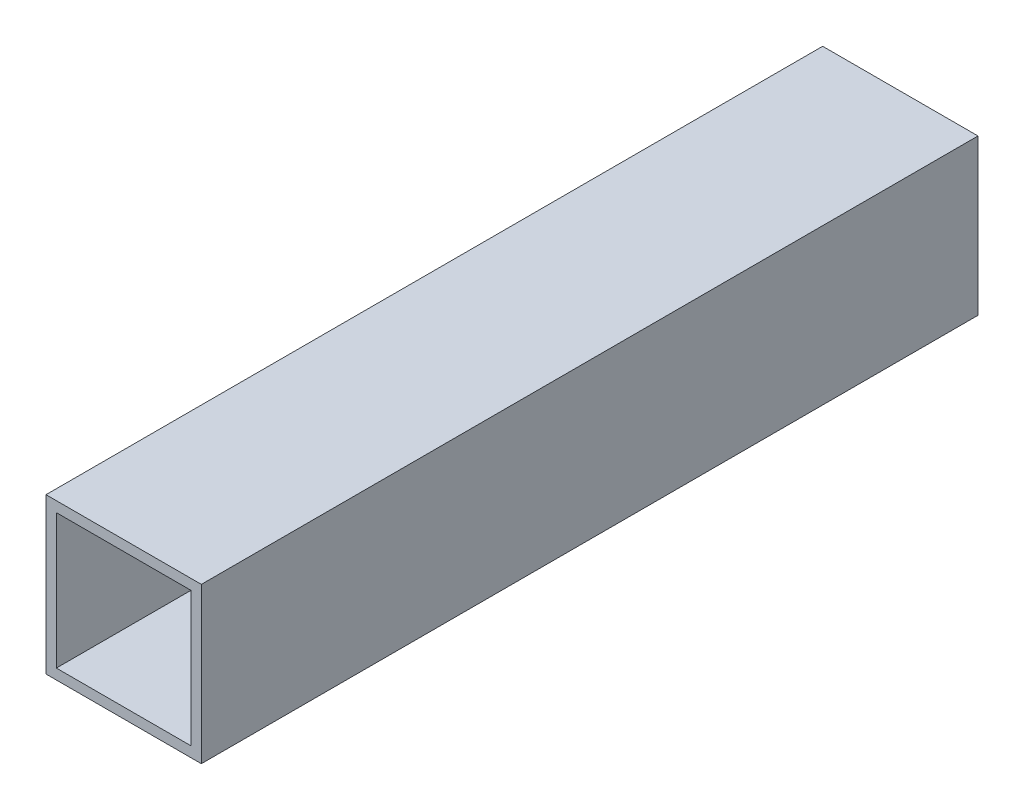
ISO-10303-21;
HEADER;
FILE_DESCRIPTION(('STEP AP214'),'2;1');
FILE_NAME('part.step','',(''),(''),'','','');
FILE_SCHEMA(('AUTOMOTIVE_DESIGN { 1 0 10303 214 1 1 1 1 }'));
ENDSEC;
DATA;
#1=APPLICATION_CONTEXT('core data for automotive mechanical design processes');
#2=APPLICATION_PROTOCOL_DEFINITION('international standard','automotive_design',2000,#1);
#3=PRODUCT_CONTEXT('',#1,'mechanical');
#4=PRODUCT('Part','Part','',(#3));
#5=PRODUCT_RELATED_PRODUCT_CATEGORY('part','',(#4));
#6=PRODUCT_DEFINITION_FORMATION('','',#4);
#7=PRODUCT_DEFINITION_CONTEXT('part definition',#1,'design');
#8=PRODUCT_DEFINITION('design','',#6,#7);
#9=PRODUCT_DEFINITION_SHAPE('','',#8);
#10=(LENGTH_UNIT() NAMED_UNIT(*) SI_UNIT(.MILLI.,.METRE.));
#11=(NAMED_UNIT(*) PLANE_ANGLE_UNIT() SI_UNIT($,.RADIAN.));
#12=(NAMED_UNIT(*) SI_UNIT($,.STERADIAN.) SOLID_ANGLE_UNIT());
#13=UNCERTAINTY_MEASURE_WITH_UNIT(LENGTH_MEASURE(1.E-05),#10,'distance_accuracy_value','');
#14=(GEOMETRIC_REPRESENTATION_CONTEXT(3) GLOBAL_UNCERTAINTY_ASSIGNED_CONTEXT((#13)) GLOBAL_UNIT_ASSIGNED_CONTEXT((#10,
#11,#12)) REPRESENTATION_CONTEXT('',''));
#15=CARTESIAN_POINT('',(0.,0.,0.));
#16=DIRECTION('',(0.,0.,1.));
#17=DIRECTION('',(1.,0.,0.));
#18=AXIS2_PLACEMENT_3D('',#15,#16,#17);
#19=CARTESIAN_POINT('',(-15.,-15.,150.));
#20=DIRECTION('',(0.,0.,1.));
#21=DIRECTION('',(1.,0.,0.));
#22=AXIS2_PLACEMENT_3D('',#19,#20,#21);
#23=PLANE('',#22);
#24=DIRECTION('',(0.,-1.,0.));
#25=VECTOR('',#24,1.);
#26=CARTESIAN_POINT('',(-15.,15.,150.));
#27=LINE('',#26,#25);
#28=CARTESIAN_POINT('',(-15.,15.,150.));
#29=VERTEX_POINT('',#28);
#30=CARTESIAN_POINT('',(-15.,-15.,150.));
#31=VERTEX_POINT('',#30);
#32=EDGE_CURVE('E155',#29,#31,#27,.T.);
#33=ORIENTED_EDGE('',*,*,#32,.T.);
#34=DIRECTION('',(1.,0.,0.));
#35=VECTOR('',#34,1.);
#36=CARTESIAN_POINT('',(-15.,-15.,150.));
#37=LINE('',#36,#35);
#38=CARTESIAN_POINT('',(15.,-15.,150.));
#39=VERTEX_POINT('',#38);
#40=EDGE_CURVE('E158',#31,#39,#37,.T.);
#41=ORIENTED_EDGE('',*,*,#40,.T.);
#42=DIRECTION('',(0.,1.,0.));
#43=VECTOR('',#42,1.);
#44=CARTESIAN_POINT('',(15.,15.,150.));
#45=LINE('',#44,#43);
#46=CARTESIAN_POINT('',(15.,15.,150.));
#47=VERTEX_POINT('',#46);
#48=EDGE_CURVE('E161',#39,#47,#45,.T.);
#49=ORIENTED_EDGE('',*,*,#48,.T.);
#50=DIRECTION('',(-1.,0.,0.));
#51=VECTOR('',#50,1.);
#52=CARTESIAN_POINT('',(-15.,15.,150.));
#53=LINE('',#52,#51);
#54=EDGE_CURVE('E163',#47,#29,#53,.T.);
#55=ORIENTED_EDGE('',*,*,#54,.T.);
#56=EDGE_LOOP('',(#33,#41,#49,#55));
#57=FACE_BOUND('',#56,.T.);
#58=DIRECTION('',(1.,0.,0.));
#59=VECTOR('',#58,1.);
#60=CARTESIAN_POINT('',(-15.,-13.,150.));
#61=LINE('',#60,#59);
#62=CARTESIAN_POINT('',(-13.,-13.,150.));
#63=VERTEX_POINT('',#62);
#64=CARTESIAN_POINT('',(13.,-13.,150.));
#65=VERTEX_POINT('',#64);
#66=EDGE_CURVE('E127',#63,#65,#61,.T.);
#67=ORIENTED_EDGE('',*,*,#66,.F.);
#68=DIRECTION('',(0.,-1.,0.));
#69=VECTOR('',#68,1.);
#70=CARTESIAN_POINT('',(-13.,15.,150.));
#71=LINE('',#70,#69);
#72=CARTESIAN_POINT('',(-13.,13.,150.));
#73=VERTEX_POINT('',#72);
#74=EDGE_CURVE('E119',#73,#63,#71,.T.);
#75=ORIENTED_EDGE('',*,*,#74,.F.);
#76=DIRECTION('',(-1.,0.,0.));
#77=VECTOR('',#76,1.);
#78=CARTESIAN_POINT('',(-15.,13.,150.));
#79=LINE('',#78,#77);
#80=CARTESIAN_POINT('',(13.,13.,150.));
#81=VERTEX_POINT('',#80);
#82=EDGE_CURVE('E141',#81,#73,#79,.T.);
#83=ORIENTED_EDGE('',*,*,#82,.F.);
#84=DIRECTION('',(0.,1.,0.));
#85=VECTOR('',#84,1.);
#86=CARTESIAN_POINT('',(13.,15.,150.));
#87=LINE('',#86,#85);
#88=EDGE_CURVE('E139',#65,#81,#87,.T.);
#89=ORIENTED_EDGE('',*,*,#88,.F.);
#90=EDGE_LOOP('',(#67,#75,#83,#89));
#91=FACE_BOUND('',#90,.T.);
#92=ADVANCED_FACE('F54',(#57,#91),#23,.T.);
#93=CARTESIAN_POINT('',(-15.,-15.,0.));
#94=DIRECTION('',(0.,0.,1.));
#95=DIRECTION('',(1.,0.,0.));
#96=AXIS2_PLACEMENT_3D('',#93,#94,#95);
#97=PLANE('',#96);
#98=DIRECTION('',(0.,-1.,0.));
#99=VECTOR('',#98,1.);
#100=CARTESIAN_POINT('',(-15.,15.,0.));
#101=LINE('',#100,#99);
#102=CARTESIAN_POINT('',(-15.,15.,0.));
#103=VERTEX_POINT('',#102);
#104=CARTESIAN_POINT('',(-15.,-15.,0.));
#105=VERTEX_POINT('',#104);
#106=EDGE_CURVE('E135',#103,#105,#101,.T.);
#107=ORIENTED_EDGE('',*,*,#106,.F.);
#108=DIRECTION('',(-1.,0.,0.));
#109=VECTOR('',#108,1.);
#110=CARTESIAN_POINT('',(-15.,15.,0.));
#111=LINE('',#110,#109);
#112=CARTESIAN_POINT('',(15.,15.,0.));
#113=VERTEX_POINT('',#112);
#114=EDGE_CURVE('E159',#113,#103,#111,.T.);
#115=ORIENTED_EDGE('',*,*,#114,.F.);
#116=DIRECTION('',(0.,1.,0.));
#117=VECTOR('',#116,1.);
#118=CARTESIAN_POINT('',(15.,15.,0.));
#119=LINE('',#118,#117);
#120=CARTESIAN_POINT('',(15.,-15.,0.));
#121=VERTEX_POINT('',#120);
#122=EDGE_CURVE('E170',#121,#113,#119,.T.);
#123=ORIENTED_EDGE('',*,*,#122,.F.);
#124=DIRECTION('',(1.,0.,0.));
#125=VECTOR('',#124,1.);
#126=CARTESIAN_POINT('',(-15.,-15.,0.));
#127=LINE('',#126,#125);
#128=EDGE_CURVE('E168',#105,#121,#127,.T.);
#129=ORIENTED_EDGE('',*,*,#128,.F.);
#130=EDGE_LOOP('',(#107,#115,#123,#129));
#131=FACE_BOUND('',#130,.T.);
#132=DIRECTION('',(0.,-1.,0.));
#133=VECTOR('',#132,1.);
#134=CARTESIAN_POINT('',(-13.,15.,0.));
#135=LINE('',#134,#133);
#136=CARTESIAN_POINT('',(-13.,13.,0.));
#137=VERTEX_POINT('',#136);
#138=CARTESIAN_POINT('',(-13.,-13.,0.));
#139=VERTEX_POINT('',#138);
#140=EDGE_CURVE('E77',#137,#139,#135,.T.);
#141=ORIENTED_EDGE('',*,*,#140,.T.);
#142=DIRECTION('',(1.,0.,0.));
#143=VECTOR('',#142,1.);
#144=CARTESIAN_POINT('',(-15.,-13.,0.));
#145=LINE('',#144,#143);
#146=CARTESIAN_POINT('',(13.,-13.,0.));
#147=VERTEX_POINT('',#146);
#148=EDGE_CURVE('E134',#139,#147,#145,.T.);
#149=ORIENTED_EDGE('',*,*,#148,.T.);
#150=DIRECTION('',(0.,1.,0.));
#151=VECTOR('',#150,1.);
#152=CARTESIAN_POINT('',(13.,15.,0.));
#153=LINE('',#152,#151);
#154=CARTESIAN_POINT('',(13.,13.,0.));
#155=VERTEX_POINT('',#154);
#156=EDGE_CURVE('E147',#147,#155,#153,.T.);
#157=ORIENTED_EDGE('',*,*,#156,.T.);
#158=DIRECTION('',(-1.,0.,0.));
#159=VECTOR('',#158,1.);
#160=CARTESIAN_POINT('',(-15.,13.,0.));
#161=LINE('',#160,#159);
#162=EDGE_CURVE('E128',#155,#137,#161,.T.);
#163=ORIENTED_EDGE('',*,*,#162,.T.);
#164=EDGE_LOOP('',(#141,#149,#157,#163));
#165=FACE_BOUND('',#164,.T.);
#166=ADVANCED_FACE('F188',(#131,#165),#97,.F.);
#167=CARTESIAN_POINT('',(-15.,15.,150.));
#168=DIRECTION('',(1.,0.,0.));
#169=DIRECTION('',(0.,1.,0.));
#170=AXIS2_PLACEMENT_3D('',#167,#168,#169);
#171=PLANE('',#170);
#172=ORIENTED_EDGE('',*,*,#106,.T.);
#173=DIRECTION('',(0.,0.,-1.));
#174=VECTOR('',#173,1.);
#175=CARTESIAN_POINT('',(-15.,-15.,150.));
#176=LINE('',#175,#174);
#177=EDGE_CURVE('E12',#31,#105,#176,.T.);
#178=ORIENTED_EDGE('',*,*,#177,.F.);
#179=ORIENTED_EDGE('',*,*,#32,.F.);
#180=DIRECTION('',(0.,0.,-1.));
#181=VECTOR('',#180,1.);
#182=CARTESIAN_POINT('',(-15.,15.,150.));
#183=LINE('',#182,#181);
#184=EDGE_CURVE('E165',#29,#103,#183,.T.);
#185=ORIENTED_EDGE('',*,*,#184,.T.);
#186=EDGE_LOOP('',(#172,#178,#179,#185));
#187=FACE_BOUND('',#186,.T.);
#188=ADVANCED_FACE('F56',(#187),#171,.F.);
#189=CARTESIAN_POINT('',(-15.,-15.,150.));
#190=DIRECTION('',(0.,1.,0.));
#191=DIRECTION('',(-1.,0.,0.));
#192=AXIS2_PLACEMENT_3D('',#189,#190,#191);
#193=PLANE('',#192);
#194=ORIENTED_EDGE('',*,*,#128,.T.);
#195=DIRECTION('',(0.,0.,-1.));
#196=VECTOR('',#195,1.);
#197=CARTESIAN_POINT('',(15.,-15.,150.));
#198=LINE('',#197,#196);
#199=EDGE_CURVE('E62',#39,#121,#198,.T.);
#200=ORIENTED_EDGE('',*,*,#199,.F.);
#201=ORIENTED_EDGE('',*,*,#40,.F.);
#202=ORIENTED_EDGE('',*,*,#177,.T.);
#203=EDGE_LOOP('',(#194,#200,#201,#202));
#204=FACE_BOUND('',#203,.T.);
#205=ADVANCED_FACE('F198',(#204),#193,.F.);
#206=CARTESIAN_POINT('',(15.,15.,150.));
#207=DIRECTION('',(-1.,0.,0.));
#208=DIRECTION('',(0.,0.,1.));
#209=AXIS2_PLACEMENT_3D('',#206,#207,#208);
#210=PLANE('',#209);
#211=ORIENTED_EDGE('',*,*,#122,.T.);
#212=DIRECTION('',(0.,0.,-1.));
#213=VECTOR('',#212,1.);
#214=CARTESIAN_POINT('',(15.,15.,150.));
#215=LINE('',#214,#213);
#216=EDGE_CURVE('E175',#47,#113,#215,.T.);
#217=ORIENTED_EDGE('',*,*,#216,.F.);
#218=ORIENTED_EDGE('',*,*,#48,.F.);
#219=ORIENTED_EDGE('',*,*,#199,.T.);
#220=EDGE_LOOP('',(#211,#217,#218,#219));
#221=FACE_BOUND('',#220,.T.);
#222=ADVANCED_FACE('F182',(#221),#210,.F.);
#223=CARTESIAN_POINT('',(-15.,15.,150.));
#224=DIRECTION('',(0.,-1.,0.));
#225=DIRECTION('',(1.,0.,0.));
#226=AXIS2_PLACEMENT_3D('',#223,#224,#225);
#227=PLANE('',#226);
#228=ORIENTED_EDGE('',*,*,#114,.T.);
#229=ORIENTED_EDGE('',*,*,#184,.F.);
#230=ORIENTED_EDGE('',*,*,#54,.F.);
#231=ORIENTED_EDGE('',*,*,#216,.T.);
#232=EDGE_LOOP('',(#228,#229,#230,#231));
#233=FACE_BOUND('',#232,.T.);
#234=ADVANCED_FACE('F192',(#233),#227,.F.);
#235=CARTESIAN_POINT('',(-13.,15.,150.));
#236=DIRECTION('',(1.,0.,0.));
#237=DIRECTION('',(0.,1.,0.));
#238=AXIS2_PLACEMENT_3D('',#235,#236,#237);
#239=PLANE('',#238);
#240=ORIENTED_EDGE('',*,*,#140,.F.);
#241=DIRECTION('',(0.,0.,-1.));
#242=VECTOR('',#241,1.);
#243=CARTESIAN_POINT('',(-13.,13.,150.));
#244=LINE('',#243,#242);
#245=EDGE_CURVE('E123',#73,#137,#244,.T.);
#246=ORIENTED_EDGE('',*,*,#245,.F.);
#247=ORIENTED_EDGE('',*,*,#74,.T.);
#248=DIRECTION('',(0.,0.,-1.));
#249=VECTOR('',#248,1.);
#250=CARTESIAN_POINT('',(-13.,-13.,150.));
#251=LINE('',#250,#249);
#252=EDGE_CURVE('E122',#63,#139,#251,.T.);
#253=ORIENTED_EDGE('',*,*,#252,.T.);
#254=EDGE_LOOP('',(#240,#246,#247,#253));
#255=FACE_BOUND('',#254,.T.);
#256=ADVANCED_FACE('F121',(#255),#239,.T.);
#257=CARTESIAN_POINT('',(-15.,-13.,150.));
#258=DIRECTION('',(0.,1.,0.));
#259=DIRECTION('',(-1.,0.,0.));
#260=AXIS2_PLACEMENT_3D('',#257,#258,#259);
#261=PLANE('',#260);
#262=ORIENTED_EDGE('',*,*,#148,.F.);
#263=ORIENTED_EDGE('',*,*,#252,.F.);
#264=ORIENTED_EDGE('',*,*,#66,.T.);
#265=DIRECTION('',(0.,0.,-1.));
#266=VECTOR('',#265,1.);
#267=CARTESIAN_POINT('',(13.,-13.,150.));
#268=LINE('',#267,#266);
#269=EDGE_CURVE('E136',#65,#147,#268,.T.);
#270=ORIENTED_EDGE('',*,*,#269,.T.);
#271=EDGE_LOOP('',(#262,#263,#264,#270));
#272=FACE_BOUND('',#271,.T.);
#273=ADVANCED_FACE('F131',(#272),#261,.T.);
#274=CARTESIAN_POINT('',(13.,15.,150.));
#275=DIRECTION('',(-1.,0.,0.));
#276=DIRECTION('',(0.,0.,1.));
#277=AXIS2_PLACEMENT_3D('',#274,#275,#276);
#278=PLANE('',#277);
#279=ORIENTED_EDGE('',*,*,#156,.F.);
#280=ORIENTED_EDGE('',*,*,#269,.F.);
#281=ORIENTED_EDGE('',*,*,#88,.T.);
#282=DIRECTION('',(0.,0.,-1.));
#283=VECTOR('',#282,1.);
#284=CARTESIAN_POINT('',(13.,13.,150.));
#285=LINE('',#284,#283);
#286=EDGE_CURVE('E69',#81,#155,#285,.T.);
#287=ORIENTED_EDGE('',*,*,#286,.T.);
#288=EDGE_LOOP('',(#279,#280,#281,#287));
#289=FACE_BOUND('',#288,.T.);
#290=ADVANCED_FACE('F221',(#289),#278,.T.);
#291=CARTESIAN_POINT('',(-15.,13.,150.));
#292=DIRECTION('',(0.,-1.,0.));
#293=DIRECTION('',(1.,0.,0.));
#294=AXIS2_PLACEMENT_3D('',#291,#292,#293);
#295=PLANE('',#294);
#296=ORIENTED_EDGE('',*,*,#162,.F.);
#297=ORIENTED_EDGE('',*,*,#286,.F.);
#298=ORIENTED_EDGE('',*,*,#82,.T.);
#299=ORIENTED_EDGE('',*,*,#245,.T.);
#300=EDGE_LOOP('',(#296,#297,#298,#299));
#301=FACE_BOUND('',#300,.T.);
#302=ADVANCED_FACE('F225',(#301),#295,.T.);
#303=CLOSED_SHELL('',(#92,#166,#188,#205,#222,#234,#256,#273,#290,#302));
#304=MANIFOLD_SOLID_BREP('B2',#303);
#305=ADVANCED_BREP_SHAPE_REPRESENTATION('',(#18,#304),#14);
#306=SHAPE_DEFINITION_REPRESENTATION(#9,#305);
ENDSEC;
END-ISO-10303-21;
